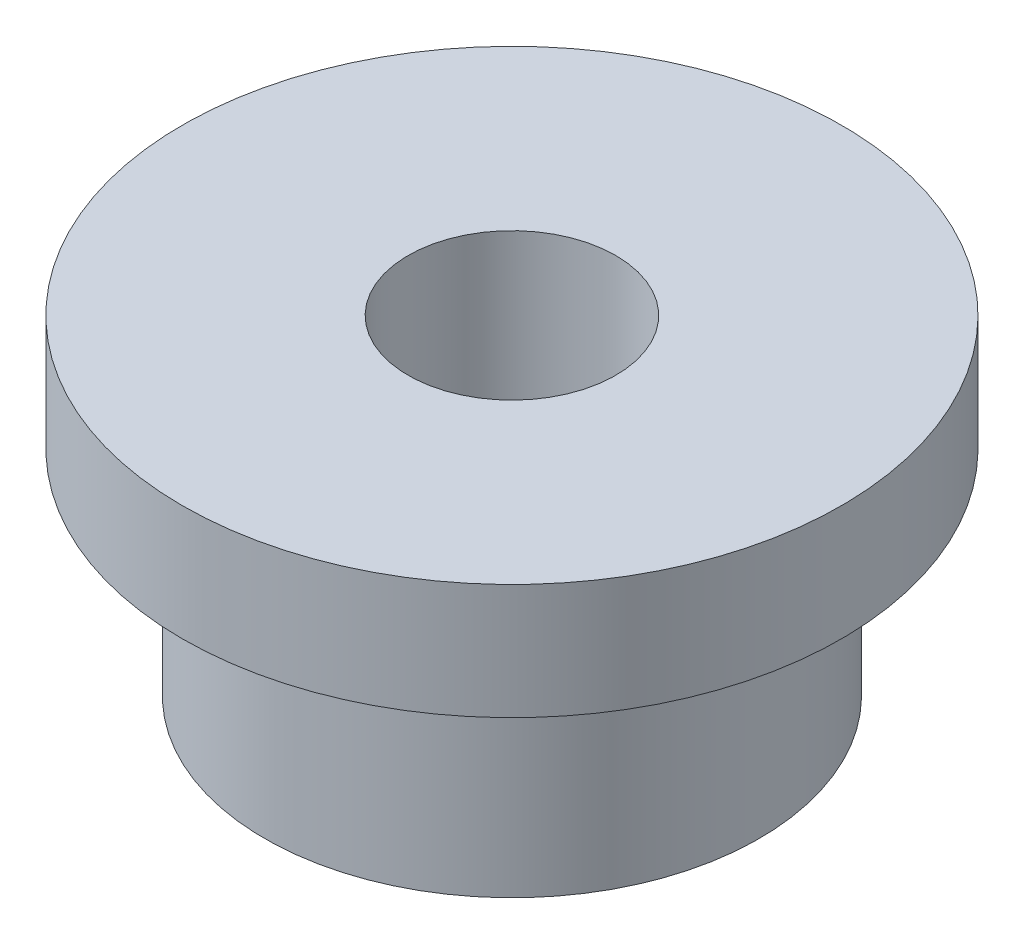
ISO-10303-21;
HEADER;
FILE_DESCRIPTION(('STEP AP214'),'2;1');
FILE_NAME('part.step','',(''),(''),'','','');
FILE_SCHEMA(('AUTOMOTIVE_DESIGN { 1 0 10303 214 1 1 1 1 }'));
ENDSEC;
DATA;
#1=APPLICATION_CONTEXT('core data for automotive mechanical design processes');
#2=APPLICATION_PROTOCOL_DEFINITION('international standard','automotive_design',2000,#1);
#3=PRODUCT_CONTEXT('',#1,'mechanical');
#4=PRODUCT('Part','Part','',(#3));
#5=PRODUCT_RELATED_PRODUCT_CATEGORY('part','',(#4));
#6=PRODUCT_DEFINITION_FORMATION('','',#4);
#7=PRODUCT_DEFINITION_CONTEXT('part definition',#1,'design');
#8=PRODUCT_DEFINITION('design','',#6,#7);
#9=PRODUCT_DEFINITION_SHAPE('','',#8);
#10=(LENGTH_UNIT() NAMED_UNIT(*) SI_UNIT(.MILLI.,.METRE.));
#11=(NAMED_UNIT(*) PLANE_ANGLE_UNIT() SI_UNIT($,.RADIAN.));
#12=(NAMED_UNIT(*) SI_UNIT($,.STERADIAN.) SOLID_ANGLE_UNIT());
#13=UNCERTAINTY_MEASURE_WITH_UNIT(LENGTH_MEASURE(1.E-05),#10,'distance_accuracy_value','');
#14=(GEOMETRIC_REPRESENTATION_CONTEXT(3) GLOBAL_UNCERTAINTY_ASSIGNED_CONTEXT((#13)) GLOBAL_UNIT_ASSIGNED_CONTEXT((#10,
#11,#12)) REPRESENTATION_CONTEXT('',''));
#15=CARTESIAN_POINT('',(0.,0.,0.));
#16=DIRECTION('',(0.,0.,1.));
#17=DIRECTION('',(1.,0.,0.));
#18=AXIS2_PLACEMENT_3D('',#15,#16,#17);
#19=CARTESIAN_POINT('',(0.,0.,0.));
#20=DIRECTION('',(0.,1.,0.));
#21=DIRECTION('',(0.,0.,1.));
#22=AXIS2_PLACEMENT_3D('',#19,#20,#21);
#23=PLANE('',#22);
#24=CARTESIAN_POINT('',(0.,0.,0.));
#25=DIRECTION('',(0.,1.,0.));
#26=DIRECTION('',(0.,0.,1.));
#27=AXIS2_PLACEMENT_3D('',#24,#25,#26);
#28=CIRCLE('',#27,7.5);
#29=CARTESIAN_POINT('',(0.,0.,-7.5));
#30=VERTEX_POINT('',#29);
#31=EDGE_CURVE('E35',#30,#30,#28,.T.);
#32=ORIENTED_EDGE('',*,*,#31,.F.);
#33=EDGE_LOOP('',(#32));
#34=FACE_BOUND('',#33,.T.);
#35=CARTESIAN_POINT('',(0.,0.,0.));
#36=DIRECTION('',(0.,1.,0.));
#37=DIRECTION('',(0.,0.,1.));
#38=AXIS2_PLACEMENT_3D('',#35,#36,#37);
#39=CIRCLE('',#38,3.15);
#40=CARTESIAN_POINT('',(0.,0.,-3.15));
#41=VERTEX_POINT('',#40);
#42=EDGE_CURVE('E42',#41,#41,#39,.T.);
#43=ORIENTED_EDGE('',*,*,#42,.T.);
#44=EDGE_LOOP('',(#43));
#45=FACE_BOUND('',#44,.T.);
#46=ADVANCED_FACE('F31',(#34,#45),#23,.F.);
#47=CARTESIAN_POINT('',(0.,6.5,0.));
#48=DIRECTION('',(0.,-1.,0.));
#49=DIRECTION('',(0.,0.,-1.));
#50=AXIS2_PLACEMENT_3D('',#47,#48,#49);
#51=CYLINDRICAL_SURFACE('',#50,7.5);
#52=CARTESIAN_POINT('',(0.,6.5,0.));
#53=DIRECTION('',(0.,1.,0.));
#54=DIRECTION('',(0.,0.,1.));
#55=AXIS2_PLACEMENT_3D('',#52,#53,#54);
#56=CIRCLE('',#55,7.5);
#57=CARTESIAN_POINT('',(0.,6.5,-7.5));
#58=VERTEX_POINT('',#57);
#59=EDGE_CURVE('E10',#58,#58,#56,.T.);
#60=CARTESIAN_POINT('',(0.,6.5,-7.5));
#61=CARTESIAN_POINT('',(0.,6.43229166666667,-7.5));
#62=CARTESIAN_POINT('',(0.,6.36458333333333,-7.5));
#63=CARTESIAN_POINT('',(0.,6.22916666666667,-7.5));
#64=CARTESIAN_POINT('',(0.,6.16145833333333,-7.5));
#65=CARTESIAN_POINT('',(0.,6.02604166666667,-7.5));
#66=CARTESIAN_POINT('',(0.,5.95833333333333,-7.5));
#67=CARTESIAN_POINT('',(0.,5.82291666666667,-7.5));
#68=CARTESIAN_POINT('',(0.,5.75520833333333,-7.5));
#69=CARTESIAN_POINT('',(0.,5.61979166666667,-7.5));
#70=CARTESIAN_POINT('',(0.,5.55208333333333,-7.5));
#71=CARTESIAN_POINT('',(0.,5.41666666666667,-7.5));
#72=CARTESIAN_POINT('',(0.,5.34895833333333,-7.5));
#73=CARTESIAN_POINT('',(0.,5.21354166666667,-7.5));
#74=CARTESIAN_POINT('',(0.,5.14583333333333,-7.5));
#75=CARTESIAN_POINT('',(0.,5.01041666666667,-7.5));
#76=CARTESIAN_POINT('',(0.,4.94270833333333,-7.5));
#77=CARTESIAN_POINT('',(0.,4.80729166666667,-7.5));
#78=CARTESIAN_POINT('',(0.,4.73958333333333,-7.5));
#79=CARTESIAN_POINT('',(0.,4.60416666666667,-7.5));
#80=CARTESIAN_POINT('',(0.,4.53645833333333,-7.5));
#81=CARTESIAN_POINT('',(0.,4.40104166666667,-7.5));
#82=CARTESIAN_POINT('',(0.,4.33333333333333,-7.5));
#83=CARTESIAN_POINT('',(0.,4.19791666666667,-7.5));
#84=CARTESIAN_POINT('',(0.,4.13020833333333,-7.5));
#85=CARTESIAN_POINT('',(0.,3.99479166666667,-7.5));
#86=CARTESIAN_POINT('',(0.,3.92708333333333,-7.5));
#87=CARTESIAN_POINT('',(0.,3.79166666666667,-7.5));
#88=CARTESIAN_POINT('',(0.,3.72395833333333,-7.5));
#89=CARTESIAN_POINT('',(0.,3.58854166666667,-7.5));
#90=CARTESIAN_POINT('',(0.,3.52083333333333,-7.5));
#91=CARTESIAN_POINT('',(0.,3.38541666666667,-7.5));
#92=CARTESIAN_POINT('',(0.,3.31770833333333,-7.5));
#93=CARTESIAN_POINT('',(0.,3.18229166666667,-7.5));
#94=CARTESIAN_POINT('',(0.,3.11458333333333,-7.5));
#95=CARTESIAN_POINT('',(0.,2.97916666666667,-7.5));
#96=CARTESIAN_POINT('',(0.,2.91145833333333,-7.5));
#97=CARTESIAN_POINT('',(0.,2.77604166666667,-7.5));
#98=CARTESIAN_POINT('',(0.,2.70833333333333,-7.5));
#99=CARTESIAN_POINT('',(0.,2.57291666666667,-7.5));
#100=CARTESIAN_POINT('',(0.,2.50520833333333,-7.5));
#101=CARTESIAN_POINT('',(0.,2.36979166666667,-7.5));
#102=CARTESIAN_POINT('',(0.,2.30208333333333,-7.5));
#103=CARTESIAN_POINT('',(0.,2.16666666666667,-7.5));
#104=CARTESIAN_POINT('',(0.,2.09895833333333,-7.5));
#105=CARTESIAN_POINT('',(0.,1.96354166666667,-7.5));
#106=CARTESIAN_POINT('',(0.,1.89583333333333,-7.5));
#107=CARTESIAN_POINT('',(0.,1.76041666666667,-7.5));
#108=CARTESIAN_POINT('',(0.,1.69270833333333,-7.5));
#109=CARTESIAN_POINT('',(0.,1.55729166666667,-7.5));
#110=CARTESIAN_POINT('',(0.,1.48958333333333,-7.5));
#111=CARTESIAN_POINT('',(0.,1.35416666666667,-7.5));
#112=CARTESIAN_POINT('',(0.,1.28645833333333,-7.5));
#113=CARTESIAN_POINT('',(0.,1.15104166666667,-7.5));
#114=CARTESIAN_POINT('',(0.,1.08333333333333,-7.5));
#115=CARTESIAN_POINT('',(0.,0.947916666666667,-7.5));
#116=CARTESIAN_POINT('',(0.,0.880208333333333,-7.5));
#117=CARTESIAN_POINT('',(0.,0.744791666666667,-7.5));
#118=CARTESIAN_POINT('',(0.,0.677083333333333,-7.5));
#119=CARTESIAN_POINT('',(0.,0.541666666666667,-7.5));
#120=CARTESIAN_POINT('',(0.,0.473958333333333,-7.5));
#121=CARTESIAN_POINT('',(0.,0.338541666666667,-7.5));
#122=CARTESIAN_POINT('',(0.,0.270833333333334,-7.5));
#123=CARTESIAN_POINT('',(0.,0.135416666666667,-7.5));
#124=CARTESIAN_POINT('',(0.,0.0677083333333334,-7.5));
#125=CARTESIAN_POINT('',(0.,0.,-7.5));
#126=B_SPLINE_CURVE_WITH_KNOTS('',3,(#60,#61,#62,#63,#64,#65,#66,#67,#68,#69,#70,#71,#72,#73,
#74,#75,#76,#77,#78,#79,#80,#81,#82,#83,#84,#85,#86,#87,#88,#89,#90,#91,#92,#93,#94,#95,#96,#97,
#98,#99,#100,#101,#102,#103,#104,#105,#106,#107,#108,#109,#110,#111,#112,#113,#114,#115,#116,
#117,#118,#119,#120,#121,#122,#123,#124,#125),.UNSPECIFIED.,.F.,.F.,(4,2,2,2,2,2,2,2,2,2,2,2,2,
2,2,2,2,2,2,2,2,2,2,2,2,2,2,2,2,2,2,2,4),(0.,0.203125,0.40625,0.609375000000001,
0.812500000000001,1.015625,1.21875,1.421875,1.625,1.828125,2.03125,2.234375,2.4375,2.640625,
2.84375,3.046875,3.25,3.453125,3.65625,3.859375,4.0625,4.265625,4.46875,4.671875,4.875,5.078125,
5.28125,5.484375,5.6875,5.890625,6.09375,6.296875,6.5),.UNSPECIFIED.);
#127=EDGE_CURVE('BSEAM33',#58,#30,#126,.T.);
#128=ORIENTED_EDGE('',*,*,#59,.F.);
#129=ORIENTED_EDGE('',*,*,#31,.T.);
#130=ORIENTED_EDGE('',*,*,#127,.T.);
#131=ORIENTED_EDGE('',*,*,#127,.F.);
#132=EDGE_LOOP('',(#128,#130,#129,#131));
#133=FACE_BOUND('',#132,.T.);
#134=ADVANCED_FACE('F33',(#133),#51,.T.);
#135=CARTESIAN_POINT('',(0.,6.5,0.));
#136=DIRECTION('',(0.,-1.,0.));
#137=DIRECTION('',(0.,0.,-1.));
#138=AXIS2_PLACEMENT_3D('',#135,#136,#137);
#139=CYLINDRICAL_SURFACE('',#138,3.15);
#140=CARTESIAN_POINT('',(0.,10.,0.));
#141=DIRECTION('',(0.,1.,0.));
#142=DIRECTION('',(0.,0.,1.));
#143=AXIS2_PLACEMENT_3D('',#140,#141,#142);
#144=CIRCLE('',#143,3.15);
#145=CARTESIAN_POINT('',(0.,10.,-3.15));
#146=VERTEX_POINT('',#145);
#147=EDGE_CURVE('E50',#146,#146,#144,.T.);
#148=CARTESIAN_POINT('',(0.,0.,-3.15));
#149=CARTESIAN_POINT('',(0.,0.104166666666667,-3.15));
#150=CARTESIAN_POINT('',(0.,0.208333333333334,-3.15));
#151=CARTESIAN_POINT('',(0.,0.416666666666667,-3.15));
#152=CARTESIAN_POINT('',(0.,0.520833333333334,-3.15));
#153=CARTESIAN_POINT('',(0.,0.729166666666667,-3.15));
#154=CARTESIAN_POINT('',(0.,0.833333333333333,-3.15));
#155=CARTESIAN_POINT('',(0.,1.04166666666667,-3.15));
#156=CARTESIAN_POINT('',(0.,1.14583333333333,-3.15));
#157=CARTESIAN_POINT('',(0.,1.35416666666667,-3.15));
#158=CARTESIAN_POINT('',(0.,1.45833333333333,-3.15));
#159=CARTESIAN_POINT('',(0.,1.66666666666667,-3.15));
#160=CARTESIAN_POINT('',(0.,1.77083333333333,-3.15));
#161=CARTESIAN_POINT('',(0.,1.97916666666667,-3.15));
#162=CARTESIAN_POINT('',(0.,2.08333333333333,-3.15));
#163=CARTESIAN_POINT('',(0.,2.29166666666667,-3.15));
#164=CARTESIAN_POINT('',(0.,2.39583333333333,-3.15));
#165=CARTESIAN_POINT('',(0.,2.60416666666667,-3.15));
#166=CARTESIAN_POINT('',(0.,2.70833333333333,-3.15));
#167=CARTESIAN_POINT('',(0.,2.91666666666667,-3.15));
#168=CARTESIAN_POINT('',(0.,3.02083333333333,-3.15));
#169=CARTESIAN_POINT('',(0.,3.22916666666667,-3.15));
#170=CARTESIAN_POINT('',(0.,3.33333333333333,-3.15));
#171=CARTESIAN_POINT('',(0.,3.54166666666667,-3.15));
#172=CARTESIAN_POINT('',(0.,3.64583333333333,-3.15));
#173=CARTESIAN_POINT('',(0.,3.85416666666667,-3.15));
#174=CARTESIAN_POINT('',(0.,3.95833333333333,-3.15));
#175=CARTESIAN_POINT('',(0.,4.16666666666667,-3.15));
#176=CARTESIAN_POINT('',(0.,4.27083333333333,-3.15));
#177=CARTESIAN_POINT('',(0.,4.47916666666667,-3.15));
#178=CARTESIAN_POINT('',(0.,4.58333333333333,-3.15));
#179=CARTESIAN_POINT('',(0.,4.79166666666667,-3.15));
#180=CARTESIAN_POINT('',(0.,4.89583333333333,-3.15));
#181=CARTESIAN_POINT('',(0.,5.10416666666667,-3.15));
#182=CARTESIAN_POINT('',(0.,5.20833333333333,-3.15));
#183=CARTESIAN_POINT('',(0.,5.41666666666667,-3.15));
#184=CARTESIAN_POINT('',(0.,5.52083333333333,-3.15));
#185=CARTESIAN_POINT('',(0.,5.72916666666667,-3.15));
#186=CARTESIAN_POINT('',(0.,5.83333333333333,-3.15));
#187=CARTESIAN_POINT('',(0.,6.04166666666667,-3.15));
#188=CARTESIAN_POINT('',(0.,6.14583333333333,-3.15));
#189=CARTESIAN_POINT('',(0.,6.35416666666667,-3.15));
#190=CARTESIAN_POINT('',(0.,6.45833333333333,-3.15));
#191=CARTESIAN_POINT('',(0.,6.66666666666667,-3.15));
#192=CARTESIAN_POINT('',(0.,6.77083333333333,-3.15));
#193=CARTESIAN_POINT('',(0.,6.97916666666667,-3.15));
#194=CARTESIAN_POINT('',(0.,7.08333333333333,-3.15));
#195=CARTESIAN_POINT('',(0.,7.29166666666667,-3.15));
#196=CARTESIAN_POINT('',(0.,7.39583333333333,-3.15));
#197=CARTESIAN_POINT('',(0.,7.60416666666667,-3.15));
#198=CARTESIAN_POINT('',(0.,7.70833333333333,-3.15));
#199=CARTESIAN_POINT('',(0.,7.91666666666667,-3.15));
#200=CARTESIAN_POINT('',(0.,8.02083333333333,-3.15));
#201=CARTESIAN_POINT('',(0.,8.22916666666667,-3.15));
#202=CARTESIAN_POINT('',(0.,8.33333333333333,-3.15));
#203=CARTESIAN_POINT('',(0.,8.54166666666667,-3.15));
#204=CARTESIAN_POINT('',(0.,8.64583333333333,-3.15));
#205=CARTESIAN_POINT('',(0.,8.85416666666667,-3.15));
#206=CARTESIAN_POINT('',(0.,8.95833333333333,-3.15));
#207=CARTESIAN_POINT('',(0.,9.16666666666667,-3.15));
#208=CARTESIAN_POINT('',(0.,9.27083333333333,-3.15));
#209=CARTESIAN_POINT('',(0.,9.47916666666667,-3.15));
#210=CARTESIAN_POINT('',(0.,9.58333333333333,-3.15));
#211=CARTESIAN_POINT('',(0.,9.79166666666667,-3.15));
#212=CARTESIAN_POINT('',(0.,9.89583333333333,-3.15));
#213=CARTESIAN_POINT('',(0.,10.,-3.15));
#214=B_SPLINE_CURVE_WITH_KNOTS('',3,(#148,#149,#150,#151,#152,#153,#154,#155,#156,#157,#158,
#159,#160,#161,#162,#163,#164,#165,#166,#167,#168,#169,#170,#171,#172,#173,#174,#175,#176,#177,
#178,#179,#180,#181,#182,#183,#184,#185,#186,#187,#188,#189,#190,#191,#192,#193,#194,#195,#196,
#197,#198,#199,#200,#201,#202,#203,#204,#205,#206,#207,#208,#209,#210,#211,#212,#213),
.UNSPECIFIED.,.F.,.F.,(4,2,2,2,2,2,2,2,2,2,2,2,2,2,2,2,2,2,2,2,2,2,2,2,2,2,2,2,2,2,2,2,4),(0.,
0.3125,0.625000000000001,0.9375,1.25,1.5625,1.875,2.1875,2.5,2.8125,3.125,3.4375,3.75,4.0625,
4.375,4.6875,5.,5.3125,5.625,5.9375,6.25,6.5625,6.875,7.1875,7.5,7.8125,8.125,8.4375,8.75,
9.0625,9.375,9.6875,10.),.UNSPECIFIED.);
#215=EDGE_CURVE('BSEAM56',#41,#146,#214,.T.);
#216=ORIENTED_EDGE('',*,*,#42,.F.);
#217=ORIENTED_EDGE('',*,*,#147,.T.);
#218=ORIENTED_EDGE('',*,*,#215,.T.);
#219=ORIENTED_EDGE('',*,*,#215,.F.);
#220=EDGE_LOOP('',(#216,#218,#217,#219));
#221=FACE_BOUND('',#220,.T.);
#222=ADVANCED_FACE('F56',(#221),#139,.F.);
#223=CARTESIAN_POINT('',(0.,6.5,0.));
#224=DIRECTION('',(0.,1.,0.));
#225=DIRECTION('',(0.,0.,1.));
#226=AXIS2_PLACEMENT_3D('',#223,#224,#225);
#227=PLANE('',#226);
#228=CARTESIAN_POINT('',(0.,6.5,0.));
#229=DIRECTION('',(0.,1.,0.));
#230=DIRECTION('',(0.,0.,1.));
#231=AXIS2_PLACEMENT_3D('',#228,#229,#230);
#232=CIRCLE('',#231,10.);
#233=CARTESIAN_POINT('',(0.,6.5,10.));
#234=VERTEX_POINT('',#233);
#235=EDGE_CURVE('E47',#234,#234,#232,.T.);
#236=ORIENTED_EDGE('',*,*,#235,.F.);
#237=EDGE_LOOP('',(#236));
#238=FACE_BOUND('',#237,.T.);
#239=ORIENTED_EDGE('',*,*,#59,.T.);
#240=EDGE_LOOP('',(#239));
#241=FACE_BOUND('',#240,.T.);
#242=ADVANCED_FACE('F61',(#238,#241),#227,.F.);
#243=CARTESIAN_POINT('',(0.,10.,0.));
#244=DIRECTION('',(0.,1.,0.));
#245=DIRECTION('',(0.,0.,1.));
#246=AXIS2_PLACEMENT_3D('',#243,#244,#245);
#247=PLANE('',#246);
#248=CARTESIAN_POINT('',(0.,10.,0.));
#249=DIRECTION('',(0.,1.,0.));
#250=DIRECTION('',(0.,0.,1.));
#251=AXIS2_PLACEMENT_3D('',#248,#249,#250);
#252=CIRCLE('',#251,10.);
#253=CARTESIAN_POINT('',(0.,10.,10.));
#254=VERTEX_POINT('',#253);
#255=EDGE_CURVE('E46',#254,#254,#252,.T.);
#256=ORIENTED_EDGE('',*,*,#255,.T.);
#257=EDGE_LOOP('',(#256));
#258=FACE_BOUND('',#257,.T.);
#259=ORIENTED_EDGE('',*,*,#147,.F.);
#260=EDGE_LOOP('',(#259));
#261=FACE_BOUND('',#260,.T.);
#262=ADVANCED_FACE('F58',(#258,#261),#247,.T.);
#263=CARTESIAN_POINT('',(0.,10.,0.));
#264=DIRECTION('',(0.,-1.,0.));
#265=DIRECTION('',(0.,0.,-1.));
#266=AXIS2_PLACEMENT_3D('',#263,#264,#265);
#267=CYLINDRICAL_SURFACE('',#266,10.);
#268=ORIENTED_EDGE('',*,*,#255,.F.);
#269=EDGE_LOOP('',(#268));
#270=FACE_BOUND('',#269,.T.);
#271=ORIENTED_EDGE('',*,*,#235,.T.);
#272=EDGE_LOOP('',(#271));
#273=FACE_BOUND('',#272,.T.);
#274=ADVANCED_FACE('F60',(#270,#273),#267,.T.);
#275=CLOSED_SHELL('',(#46,#134,#222,#242,#262,#274));
#276=MANIFOLD_SOLID_BREP('B2',#275);
#277=ADVANCED_BREP_SHAPE_REPRESENTATION('',(#18,#276),#14);
#278=SHAPE_DEFINITION_REPRESENTATION(#9,#277);
ENDSEC;
END-ISO-10303-21;
